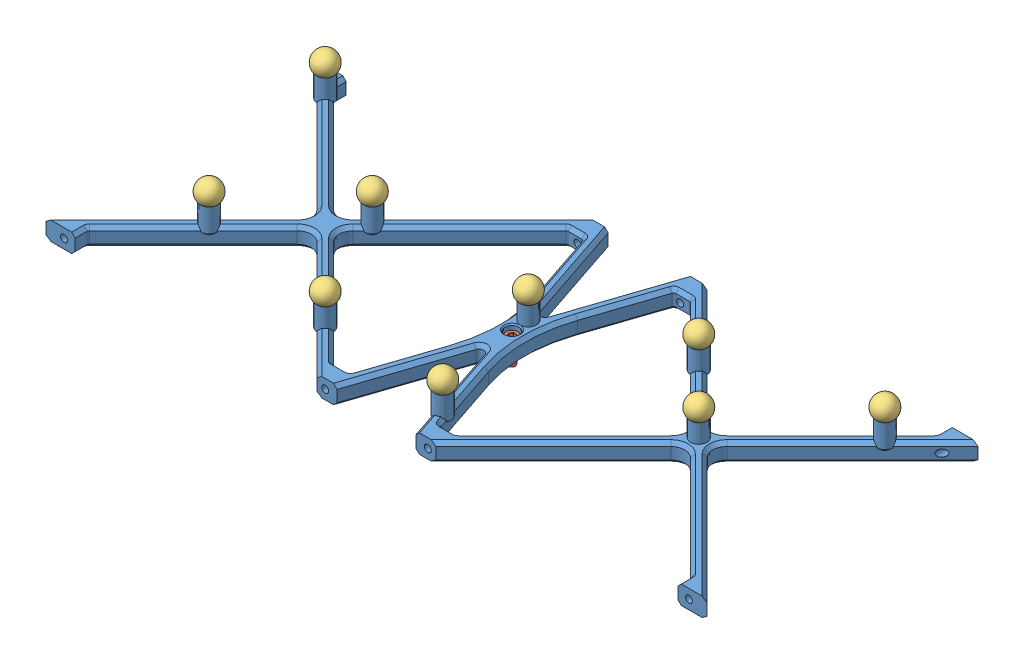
SolidWorks assembly body_structure_top_vicon.SLDASM, configuration Standard (file format 10000). Lengths in mm.
Overall size (283.47 29.2 116.2).
11 component instances, 3 part files, 20 mates.
Components (placement in the parent):
- body_structure_top_vicon-1: body_structure_top_vicon.SLDPRT [Standard] at origin size (283.47 16 116.2)
- fastener_shcs_m3_8-1: fastener_shcs_m3_8.SLDPRT [Standard] at (0 -1 0) x (-0.837169 0 -0.546944) z (0 1 0) size (5.5 5.5 11)
- vicon_marker_10mm-1: vicon_marker_10mm.SLDPRT [Standard] at (-128 15.35 -47.9) size (9.7 13.2 9.7)
- vicon_marker_10mm-2: vicon_marker_10mm.SLDPRT [Standard] at (-105 15.35 24.9) size (9.7 13.2 9.7)
- vicon_marker_10mm-3: vicon_marker_10mm.SLDPRT [Standard] at (-70 15.35 -10.1) size (9.7 13.2 9.7)
- vicon_marker_10mm-4: vicon_marker_10mm.SLDPRT [Standard] at (-43 15.35 37.1) size (9.7 13.2 9.7)
- vicon_marker_10mm-5: vicon_marker_10mm.SLDPRT [Standard] at (0 15.35 -7) x (0.962164 0 0.272472) z (-0.272472 0 0.962164) size (9.7 13.2 9.7)
- vicon_marker_10mm-6: vicon_marker_10mm.SLDPRT [Standard] at (15 15.35 44.6923) size (9.7 13.2 9.7)
- vicon_marker_10mm-7: vicon_marker_10mm.SLDPRT [Standard] at (53 15.35 -27.1) size (9.7 13.2 9.7)
- vicon_marker_10mm-8: vicon_marker_10mm.SLDPRT [Standard] at (80.1 15.35 0) x (0.998248 0 -0.059163) z (0.059163 0 0.998248) size (9.7 13.2 9.7)
- vicon_marker_10mm-9: vicon_marker_10mm.SLDPRT [Standard] at (120 15.35 -39.9) size (9.7 13.2 9.7)
Mates (geometry in assembly coordinates):
- Konzentrisch1: concentric aligned: cylinder of body_structure_top_vicon-1 through (0 -4 0) axis (0 1 0) radius 1.5; cylinder of fastener_shcs_m3_8-1 through (0 20.9199 0) axis (0 1 0) radius 1.465
- Deckungsgleich1: coincident anti-aligned: plane of body_structure_top_vicon-1 through (0 -1 0) normal (0 1 0); plane of fastener_shcs_m3_8-1 through (-1.5041 -1 2.3022) normal (0 -1 0)
- Konzentrisch2: concentric anti-aligned: cylinder of body_structure_top_vicon-1 through (-128 12 -47.9) axis (0 -1 0) radius 1.65; cylinder of vicon_marker_10mm-1 through (-128 7 -47.9) axis (0 1 0) radius 2
- Deckungsgleich2: coincident anti-aligned: plane of body_structure_top_vicon-1 through (-128 12 -47.9) normal (0 1 0); plane of vicon_marker_10mm-1 through (-128 12 -47.9) normal (0 -1 0)
- Konzentrisch3: concentric anti-aligned: cylinder of body_structure_top_vicon-1 through (-105 12 24.9) axis (0 -1 0) radius 1.65; cylinder of vicon_marker_10mm-2 through (-105 7 24.9) axis (0 1 0) radius 2
- Deckungsgleich3: coincident anti-aligned: plane of body_structure_top_vicon-1 through (-105 12 24.9) normal (0 1 0); plane of vicon_marker_10mm-2 through (-105 12 24.9) normal (0 -1 0)
- Konzentrisch4: concentric anti-aligned: cylinder of body_structure_top_vicon-1 through (-43 12 37.1) axis (0 -1 0) radius 1.65; cylinder of vicon_marker_10mm-4 through (-43 7 37.1) axis (0 1 0) radius 2
- Deckungsgleich4: coincident anti-aligned: plane of body_structure_top_vicon-1 through (-43 12 37.1) normal (0 1 0); plane of vicon_marker_10mm-4 through (-43 12 37.1) normal (0 -1 0)
- Konzentrisch5: concentric anti-aligned: cylinder of body_structure_top_vicon-1 through (-70 12 -10.1) axis (0 -1 0) radius 1.65; cylinder of vicon_marker_10mm-3 through (-70 7 -10.1) axis (0 1 0) radius 2
- Deckungsgleich5: coincident anti-aligned: plane of body_structure_top_vicon-1 through (-70 12 -10.1) normal (0 1 0); plane of vicon_marker_10mm-3 through (-70 12 -10.1) normal (0 -1 0)
- Konzentrisch6: concentric anti-aligned: cylinder of body_structure_top_vicon-1 through (0 12 -7) axis (0 -1 0) radius 1.65; cylinder of vicon_marker_10mm-5 through (0 7 -7) axis (0 1 0) radius 2
- Deckungsgleich6: coincident anti-aligned: plane of body_structure_top_vicon-1 through (0 12 -7) normal (0 1 0); plane of vicon_marker_10mm-5 through (0 12 -7) normal (0 -1 0)
- Konzentrisch7: concentric anti-aligned: cylinder of body_structure_top_vicon-1 through (15 12 44.6923) axis (0 -1 0) radius 1.65; cylinder of vicon_marker_10mm-6 through (15 7 44.6923) axis (0 1 0) radius 2
- Deckungsgleich7: coincident anti-aligned: plane of body_structure_top_vicon-1 through (15 12 44.6923) normal (0 1 0); plane of vicon_marker_10mm-6 through (15 12 44.6923) normal (0 -1 0)
- Konzentrisch8: concentric anti-aligned: cylinder of body_structure_top_vicon-1 through (53 12 -27.1) axis (0 -1 0) radius 1.65; cylinder of vicon_marker_10mm-7 through (53 7 -27.1) axis (0 1 0) radius 2
- Deckungsgleich8: coincident anti-aligned: plane of body_structure_top_vicon-1 through (53 12 -27.1) normal (0 1 0); plane of vicon_marker_10mm-7 through (53 12 -27.1) normal (0 -1 0)
- Konzentrisch9: concentric anti-aligned: cylinder of body_structure_top_vicon-1 through (80.1 12 0) axis (0 -1 0) radius 1.65; cylinder of vicon_marker_10mm-8 through (80.1 7 0) axis (0 1 0) radius 2
- Deckungsgleich9: coincident anti-aligned: plane of body_structure_top_vicon-1 through (80.1 12 0) normal (0 1 0); plane of vicon_marker_10mm-8 through (80.1 12 0) normal (0 -1 0)
- Konzentrisch10: concentric anti-aligned: cylinder of body_structure_top_vicon-1 through (120 12 -39.9) axis (0 -1 0) radius 1.65; cylinder of vicon_marker_10mm-9 through (120 7 -39.9) axis (0 1 0) radius 2
- Deckungsgleich10: coincident anti-aligned: plane of body_structure_top_vicon-1 through (120 12 -39.9) normal (0 1 0); plane of vicon_marker_10mm-9 through (120 12 -39.9) normal (0 -1 0)
